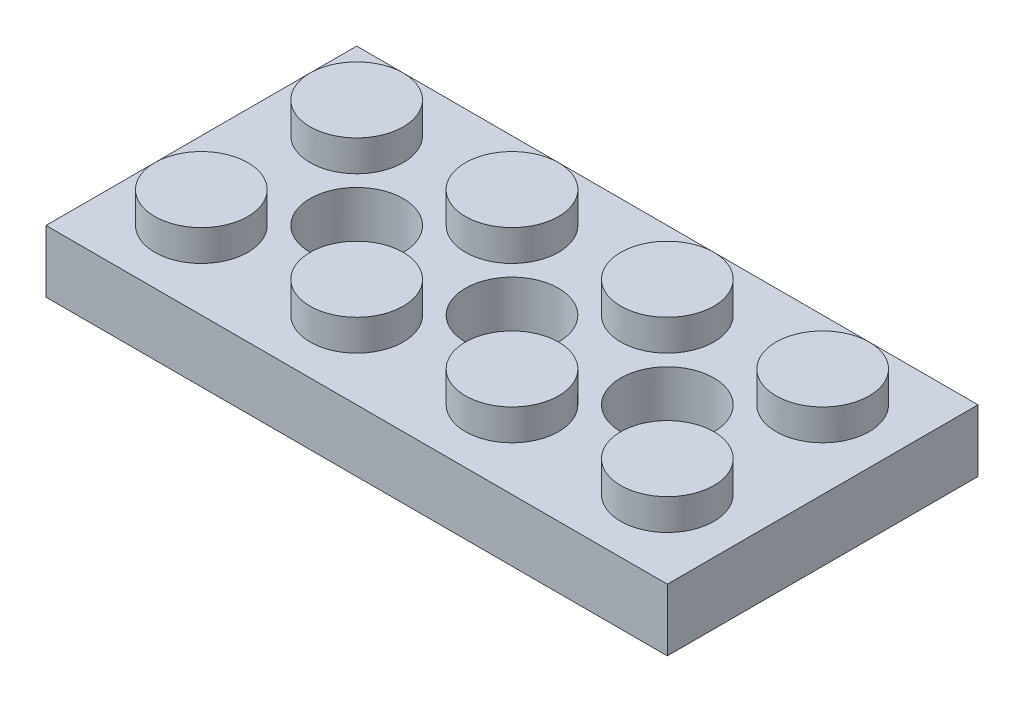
from build123d import *

# Parameters (mm, degrees)
SKETCH1_W           = 32
SKETCH1_H           = 8
BOSS_EXTRUDE1_DEPTH = 3.2
SKETCH2_R           = 2.4
BOSS_EXTRUDE2_DEPTH = 1.6
SHELL1_T            = -1.6
BOSS_EXTRUDE5_REACH = 22.568
SKETCH9_R           = 3.25
SKETCH7_R           = 2.4
CUT_EXTRUDE3_DEPTH  = 21.567936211
LPATTERN3_COUNT     = 3
LPATTERN3_PITCH     = 8


with BuildPart() as part:
    # Sketch1 → Boss-Extrude1 (new body)
    with BuildSketch(Plane(origin=(0, 0, 0), x_dir=(1, 0, 0), z_dir=(0, 1, 0))):
        Rectangle(SKETCH1_W, SKETCH1_H)
    boss_extrude1 = extrude(amount=BOSS_EXTRUDE1_DEPTH)

    # Sketch2 → Boss-Extrude2 (add)
    with BuildSketch(Plane(origin=(0, 3.2, 0), x_dir=(1, 0, 0), z_dir=(0, 1, 0))):
        with Locations(Location((-12, 0, 0), (0, 0, 90))):
            Circle(SKETCH2_R)
        with Locations(Location((-4, 0, 0), (0, 0, 90))):
            Circle(SKETCH2_R)
        with Locations(Location((4, 0, 0), (0, 0, 90))):
            Circle(SKETCH2_R)
        with Locations(Location((12, 0, 0), (0, 0, 90))):
            Circle(SKETCH2_R)
    boss_extrude2 = extrude(amount=BOSS_EXTRUDE2_DEPTH)

    # Mirror2: Boss-Extrude1, Boss-Extrude2 across plane
    add(boss_extrude1.mirror(Plane.XY.offset(4)))
    add(boss_extrude2.mirror(Plane.XY.offset(4)))

    # Shell1
    shell1_openings = [part.faces().sort_by_distance(p)[0] for p in [
        (0, 0, 4),
    ]]
    offset(amount=SHELL1_T, openings=shell1_openings, kind=Kind.INTERSECTION)

    # Sketch9 → Boss-Extrude5 (add, up to next)
    with BuildSketch(Plane(origin=(0, 0, 0), x_dir=(1, 0, 0), z_dir=(0, 1, 0)), mode=Mode.PRIVATE) as boss_extrude5_sk1:
        with Locations(Location((8, -4, 0), (0, 0, 90))):
            Circle(SKETCH9_R)
    boss_extrude5_tool1 = extrude(boss_extrude5_sk1.sketch, amount=BOSS_EXTRUDE5_REACH, mode=Mode.PRIVATE) - part.part
    boss_extrude5 = boss_extrude5_tool1.solids().sort_by_distance((8, 0, 4))[0]
    add(boss_extrude5)

    # Sketch7 → Cut-Extrude3 (cut, through all)
    with BuildSketch(Plane(origin=(0, 0, 0), x_dir=(1, 0, 0), z_dir=(0, 1, 0))):
        with Locations(Location((8, -4, 0), (0, 0, 90))):
            Circle(SKETCH7_R)
    cut_extrude3 = extrude(amount=CUT_EXTRUDE3_DEPTH, mode=Mode.SUBTRACT)

    # LPattern3: Boss-Extrude5, Cut-Extrude3 ×3
    with Locations(*[(-i * LPATTERN3_PITCH, 0, 0) for i in range(1, LPATTERN3_COUNT)]):
        add(boss_extrude5)
        add(cut_extrude3, mode=Mode.SUBTRACT)


solid = part.part
